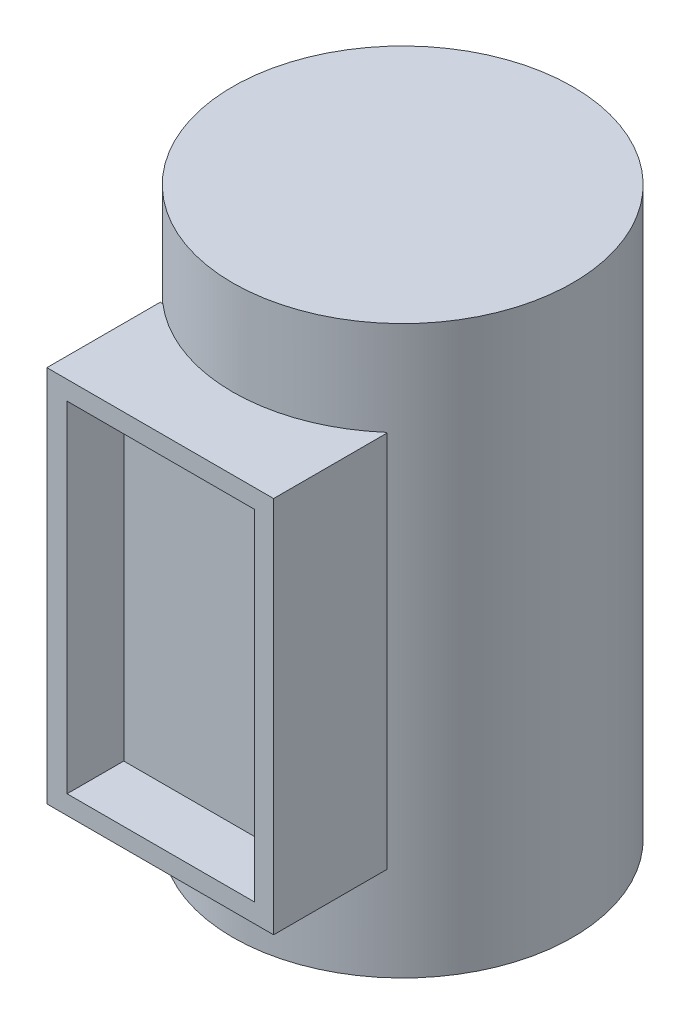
from build123d import *

# Parameters (mm, degrees)
SALIENTE_EXTRUIR1_DEPTH      = 75
SALIENTE_EXTRUIR1_DEPTH_BACK = 75
CROQUIS1_R                   = 45
SALIENTE_EXTRUIR2_DEPTH      = 50
SALIENTE_EXTRUIR2_DEPTH_BACK = 50
CROQUIS4_W                   = 60
CROQUIS4_H                   = 30
CROQUIS5_W                   = 49.652946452
CROQUIS5_H                   = 90
CORTAR_EXTRUIR2_DEPTH        = 15
CROQUIS2_R                   = 40
CORTAR_EXTRUIR1_DEPTH        = 145


with BuildPart() as part:
    # Croquis1 → Saliente-Extruir1 (new, two sides: drawn at the far end of the back side and taken through both)
    with BuildSketch(Plane(origin=(0, 0, 0), x_dir=(1, 0, 0), z_dir=(0, 1, 0)).offset(-SALIENTE_EXTRUIR1_DEPTH_BACK)):
        with Locations(Location((0, 0, 0), (0, 0, 270))):
            Circle(CROQUIS1_R)
    extrude(amount=SALIENTE_EXTRUIR1_DEPTH + SALIENTE_EXTRUIR1_DEPTH_BACK)

    # Croquis4 → Saliente-Extruir2 (add, two sides: drawn at the far end of the back side and taken through both)
    with BuildSketch(Plane(origin=(0, 0, 0), x_dir=(1, 0, 0), z_dir=(0, 1, 0)).offset(-SALIENTE_EXTRUIR2_DEPTH_BACK)):
        with Locations((-0.173526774, -49)):
            Rectangle(CROQUIS4_W, CROQUIS4_H)
    extrude(amount=SALIENTE_EXTRUIR2_DEPTH + SALIENTE_EXTRUIR2_DEPTH_BACK)

    # Croquis5 → Cortar-Extruir2 (cut)
    with BuildSketch(Plane.XY.offset(64)):
        Rectangle(CROQUIS5_W, CROQUIS5_H)
    extrude(amount=-CORTAR_EXTRUIR2_DEPTH, mode=Mode.SUBTRACT)

    # Croquis2 → Cortar-Extruir1 (cut)
    with BuildSketch(Plane.XZ.offset(75)):
        with Locations(Location((0, 0, 0), (0, 0, 270))):
            Circle(CROQUIS2_R)
    extrude(amount=-CORTAR_EXTRUIR1_DEPTH, mode=Mode.SUBTRACT)


solid = part.part
